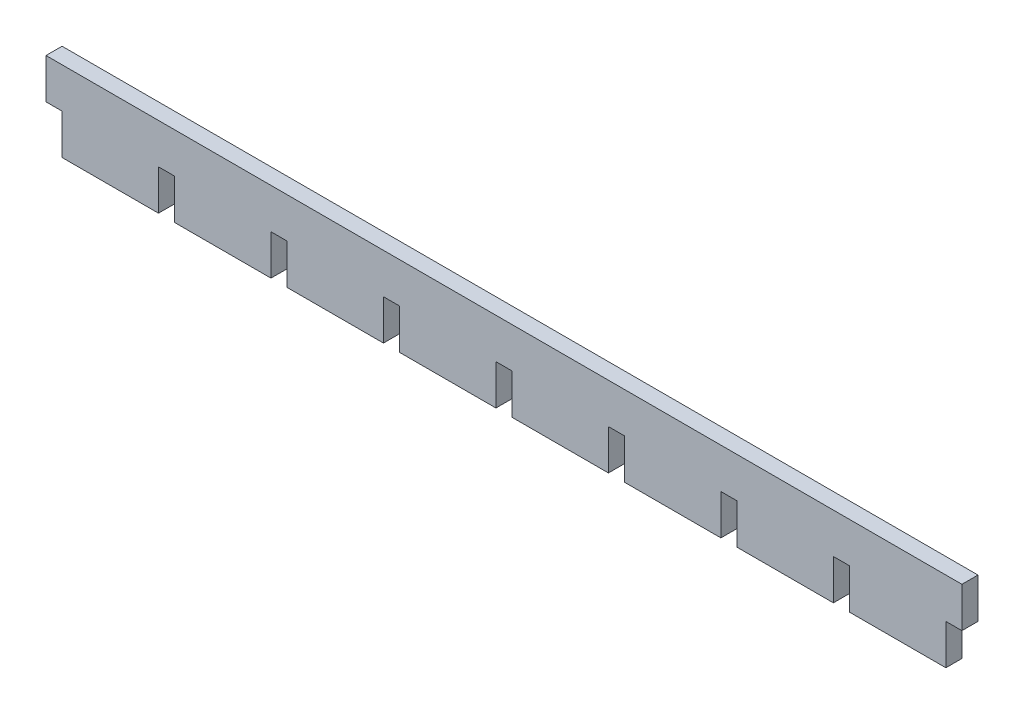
ISO-10303-21;
HEADER;
FILE_DESCRIPTION(('STEP AP214'),'2;1');
FILE_NAME('part.step','',(''),(''),'','','');
FILE_SCHEMA(('AUTOMOTIVE_DESIGN { 1 0 10303 214 1 1 1 1 }'));
ENDSEC;
DATA;
#1=APPLICATION_CONTEXT('core data for automotive mechanical design processes');
#2=APPLICATION_PROTOCOL_DEFINITION('international standard','automotive_design',2000,#1);
#3=PRODUCT_CONTEXT('',#1,'mechanical');
#4=PRODUCT('Part','Part','',(#3));
#5=PRODUCT_RELATED_PRODUCT_CATEGORY('part','',(#4));
#6=PRODUCT_DEFINITION_FORMATION('','',#4);
#7=PRODUCT_DEFINITION_CONTEXT('part definition',#1,'design');
#8=PRODUCT_DEFINITION('design','',#6,#7);
#9=PRODUCT_DEFINITION_SHAPE('','',#8);
#10=(LENGTH_UNIT() NAMED_UNIT(*) SI_UNIT(.MILLI.,.METRE.));
#11=(NAMED_UNIT(*) PLANE_ANGLE_UNIT() SI_UNIT($,.RADIAN.));
#12=(NAMED_UNIT(*) SI_UNIT($,.STERADIAN.) SOLID_ANGLE_UNIT());
#13=UNCERTAINTY_MEASURE_WITH_UNIT(LENGTH_MEASURE(1.E-05),#10,'distance_accuracy_value','');
#14=(GEOMETRIC_REPRESENTATION_CONTEXT(3) GLOBAL_UNCERTAINTY_ASSIGNED_CONTEXT((#13)) GLOBAL_UNIT_ASSIGNED_CONTEXT((#10,
#11,#12)) REPRESENTATION_CONTEXT('',''));
#15=CARTESIAN_POINT('',(0.,0.,0.));
#16=DIRECTION('',(0.,0.,1.));
#17=DIRECTION('',(1.,0.,0.));
#18=AXIS2_PLACEMENT_3D('',#15,#16,#17);
#19=CARTESIAN_POINT('',(336.,0.,6.));
#20=DIRECTION('',(1.,0.,0.));
#21=DIRECTION('',(0.,0.,-1.));
#22=AXIS2_PLACEMENT_3D('',#19,#20,#21);
#23=PLANE('',#22);
#24=DIRECTION('',(0.,-1.,0.));
#25=VECTOR('',#24,1.);
#26=CARTESIAN_POINT('',(336.,0.,0.));
#27=LINE('',#26,#25);
#28=CARTESIAN_POINT('',(336.,15.,0.));
#29=VERTEX_POINT('',#28);
#30=CARTESIAN_POINT('',(336.,0.,0.));
#31=VERTEX_POINT('',#30);
#32=EDGE_CURVE('E296',#29,#31,#27,.T.);
#33=ORIENTED_EDGE('',*,*,#32,.F.);
#34=DIRECTION('',(0.,0.,-1.));
#35=VECTOR('',#34,1.);
#36=CARTESIAN_POINT('',(336.,15.,6.));
#37=LINE('',#36,#35);
#38=CARTESIAN_POINT('',(336.,15.,6.));
#39=VERTEX_POINT('',#38);
#40=EDGE_CURVE('E11',#39,#29,#37,.T.);
#41=ORIENTED_EDGE('',*,*,#40,.F.);
#42=DIRECTION('',(0.,-1.,0.));
#43=VECTOR('',#42,1.);
#44=CARTESIAN_POINT('',(336.,0.,6.));
#45=LINE('',#44,#43);
#46=CARTESIAN_POINT('',(336.,0.,6.));
#47=VERTEX_POINT('',#46);
#48=EDGE_CURVE('E465',#39,#47,#45,.T.);
#49=ORIENTED_EDGE('',*,*,#48,.T.);
#50=DIRECTION('',(0.,0.,-1.));
#51=VECTOR('',#50,1.);
#52=CARTESIAN_POINT('',(336.,0.,6.));
#53=LINE('',#52,#51);
#54=EDGE_CURVE('E170',#47,#31,#53,.T.);
#55=ORIENTED_EDGE('',*,*,#54,.T.);
#56=EDGE_LOOP('',(#33,#41,#49,#55));
#57=FACE_BOUND('',#56,.T.);
#58=ADVANCED_FACE('F36',(#57),#23,.T.);
#59=CARTESIAN_POINT('',(0.,15.,6.));
#60=DIRECTION('',(0.,-1.,0.));
#61=DIRECTION('',(0.,0.,-1.));
#62=AXIS2_PLACEMENT_3D('',#59,#60,#61);
#63=PLANE('',#62);
#64=DIRECTION('',(-1.,0.,0.));
#65=VECTOR('',#64,1.);
#66=CARTESIAN_POINT('',(0.,15.,0.));
#67=LINE('',#66,#65);
#68=CARTESIAN_POINT('',(342.,15.,0.));
#69=VERTEX_POINT('',#68);
#70=EDGE_CURVE('E299',#69,#29,#67,.T.);
#71=ORIENTED_EDGE('',*,*,#70,.F.);
#72=DIRECTION('',(0.,0.,-1.));
#73=VECTOR('',#72,1.);
#74=CARTESIAN_POINT('',(342.,15.,6.));
#75=LINE('',#74,#73);
#76=CARTESIAN_POINT('',(342.,15.,6.));
#77=VERTEX_POINT('',#76);
#78=EDGE_CURVE('E44',#77,#69,#75,.T.);
#79=ORIENTED_EDGE('',*,*,#78,.F.);
#80=DIRECTION('',(-1.,0.,0.));
#81=VECTOR('',#80,1.);
#82=CARTESIAN_POINT('',(0.,15.,6.));
#83=LINE('',#82,#81);
#84=EDGE_CURVE('E462',#77,#39,#83,.T.);
#85=ORIENTED_EDGE('',*,*,#84,.T.);
#86=ORIENTED_EDGE('',*,*,#40,.T.);
#87=EDGE_LOOP('',(#71,#79,#85,#86));
#88=FACE_BOUND('',#87,.T.);
#89=ADVANCED_FACE('F461',(#88),#63,.T.);
#90=CARTESIAN_POINT('',(342.,0.,6.));
#91=DIRECTION('',(-1.,0.,0.));
#92=DIRECTION('',(0.,0.,1.));
#93=AXIS2_PLACEMENT_3D('',#90,#91,#92);
#94=PLANE('',#93);
#95=DIRECTION('',(0.,1.,0.));
#96=VECTOR('',#95,1.);
#97=CARTESIAN_POINT('',(342.,0.,0.));
#98=LINE('',#97,#96);
#99=CARTESIAN_POINT('',(342.,30.,0.));
#100=VERTEX_POINT('',#99);
#101=EDGE_CURVE('E302',#69,#100,#98,.T.);
#102=ORIENTED_EDGE('',*,*,#101,.T.);
#103=DIRECTION('',(0.,0.,-1.));
#104=VECTOR('',#103,1.);
#105=CARTESIAN_POINT('',(342.,30.,6.));
#106=LINE('',#105,#104);
#107=CARTESIAN_POINT('',(342.,30.,6.));
#108=VERTEX_POINT('',#107);
#109=EDGE_CURVE('E447',#108,#100,#106,.T.);
#110=ORIENTED_EDGE('',*,*,#109,.F.);
#111=DIRECTION('',(0.,1.,0.));
#112=VECTOR('',#111,1.);
#113=CARTESIAN_POINT('',(342.,0.,6.));
#114=LINE('',#113,#112);
#115=EDGE_CURVE('E453',#77,#108,#114,.T.);
#116=ORIENTED_EDGE('',*,*,#115,.F.);
#117=ORIENTED_EDGE('',*,*,#78,.T.);
#118=EDGE_LOOP('',(#102,#110,#116,#117));
#119=FACE_BOUND('',#118,.T.);
#120=ADVANCED_FACE('F451',(#119),#94,.F.);
#121=CARTESIAN_POINT('',(0.,30.,6.));
#122=DIRECTION('',(0.,1.,0.));
#123=DIRECTION('',(0.,0.,1.));
#124=AXIS2_PLACEMENT_3D('',#121,#122,#123);
#125=PLANE('',#124);
#126=DIRECTION('',(1.,0.,0.));
#127=VECTOR('',#126,1.);
#128=CARTESIAN_POINT('',(0.,30.,0.));
#129=LINE('',#128,#127);
#130=CARTESIAN_POINT('',(0.,30.,0.));
#131=VERTEX_POINT('',#130);
#132=EDGE_CURVE('E305',#131,#100,#129,.T.);
#133=ORIENTED_EDGE('',*,*,#132,.F.);
#134=DIRECTION('',(0.,0.,-1.));
#135=VECTOR('',#134,1.);
#136=CARTESIAN_POINT('',(0.,30.,6.));
#137=LINE('',#136,#135);
#138=CARTESIAN_POINT('',(0.,30.,6.));
#139=VERTEX_POINT('',#138);
#140=EDGE_CURVE('E445',#139,#131,#137,.T.);
#141=ORIENTED_EDGE('',*,*,#140,.F.);
#142=DIRECTION('',(1.,0.,0.));
#143=VECTOR('',#142,1.);
#144=CARTESIAN_POINT('',(0.,30.,6.));
#145=LINE('',#144,#143);
#146=EDGE_CURVE('E572',#139,#108,#145,.T.);
#147=ORIENTED_EDGE('',*,*,#146,.T.);
#148=ORIENTED_EDGE('',*,*,#109,.T.);
#149=EDGE_LOOP('',(#133,#141,#147,#148));
#150=FACE_BOUND('',#149,.T.);
#151=ADVANCED_FACE('F579',(#150),#125,.T.);
#152=CARTESIAN_POINT('',(0.,0.,6.));
#153=DIRECTION('',(-1.,0.,0.));
#154=DIRECTION('',(0.,0.,1.));
#155=AXIS2_PLACEMENT_3D('',#152,#153,#154);
#156=PLANE('',#155);
#157=DIRECTION('',(0.,1.,0.));
#158=VECTOR('',#157,1.);
#159=CARTESIAN_POINT('',(0.,0.,0.));
#160=LINE('',#159,#158);
#161=CARTESIAN_POINT('',(0.,15.,0.));
#162=VERTEX_POINT('',#161);
#163=EDGE_CURVE('E308',#162,#131,#160,.T.);
#164=ORIENTED_EDGE('',*,*,#163,.F.);
#165=DIRECTION('',(0.,0.,-1.));
#166=VECTOR('',#165,1.);
#167=CARTESIAN_POINT('',(0.,15.,6.));
#168=LINE('',#167,#166);
#169=CARTESIAN_POINT('',(0.,15.,6.));
#170=VERTEX_POINT('',#169);
#171=EDGE_CURVE('E443',#170,#162,#168,.T.);
#172=ORIENTED_EDGE('',*,*,#171,.F.);
#173=DIRECTION('',(0.,1.,0.));
#174=VECTOR('',#173,1.);
#175=CARTESIAN_POINT('',(0.,0.,6.));
#176=LINE('',#175,#174);
#177=EDGE_CURVE('E567',#170,#139,#176,.T.);
#178=ORIENTED_EDGE('',*,*,#177,.T.);
#179=ORIENTED_EDGE('',*,*,#140,.T.);
#180=EDGE_LOOP('',(#164,#172,#178,#179));
#181=FACE_BOUND('',#180,.T.);
#182=ADVANCED_FACE('F582',(#181),#156,.T.);
#183=CARTESIAN_POINT('',(0.,15.,6.));
#184=DIRECTION('',(0.,1.,0.));
#185=DIRECTION('',(0.,0.,1.));
#186=AXIS2_PLACEMENT_3D('',#183,#184,#185);
#187=PLANE('',#186);
#188=DIRECTION('',(1.,0.,0.));
#189=VECTOR('',#188,1.);
#190=CARTESIAN_POINT('',(0.,15.,0.));
#191=LINE('',#190,#189);
#192=CARTESIAN_POINT('',(6.,15.,0.));
#193=VERTEX_POINT('',#192);
#194=EDGE_CURVE('E311',#162,#193,#191,.T.);
#195=ORIENTED_EDGE('',*,*,#194,.T.);
#196=DIRECTION('',(0.,0.,-1.));
#197=VECTOR('',#196,1.);
#198=CARTESIAN_POINT('',(6.,15.,6.));
#199=LINE('',#198,#197);
#200=CARTESIAN_POINT('',(6.,15.,6.));
#201=VERTEX_POINT('',#200);
#202=EDGE_CURVE('E440',#201,#193,#199,.T.);
#203=ORIENTED_EDGE('',*,*,#202,.F.);
#204=DIRECTION('',(1.,0.,0.));
#205=VECTOR('',#204,1.);
#206=CARTESIAN_POINT('',(0.,15.,6.));
#207=LINE('',#206,#205);
#208=EDGE_CURVE('E564',#170,#201,#207,.T.);
#209=ORIENTED_EDGE('',*,*,#208,.F.);
#210=ORIENTED_EDGE('',*,*,#171,.T.);
#211=EDGE_LOOP('',(#195,#203,#209,#210));
#212=FACE_BOUND('',#211,.T.);
#213=ADVANCED_FACE('F586',(#212),#187,.F.);
#214=CARTESIAN_POINT('',(6.,0.,6.));
#215=DIRECTION('',(1.,0.,0.));
#216=DIRECTION('',(0.,0.,-1.));
#217=AXIS2_PLACEMENT_3D('',#214,#215,#216);
#218=PLANE('',#217);
#219=DIRECTION('',(0.,-1.,0.));
#220=VECTOR('',#219,1.);
#221=CARTESIAN_POINT('',(6.,0.,0.));
#222=LINE('',#221,#220);
#223=CARTESIAN_POINT('',(6.,0.,0.));
#224=VERTEX_POINT('',#223);
#225=EDGE_CURVE('E313',#193,#224,#222,.T.);
#226=ORIENTED_EDGE('',*,*,#225,.T.);
#227=DIRECTION('',(0.,0.,-1.));
#228=VECTOR('',#227,1.);
#229=CARTESIAN_POINT('',(6.,0.,6.));
#230=LINE('',#229,#228);
#231=CARTESIAN_POINT('',(6.,0.,6.));
#232=VERTEX_POINT('',#231);
#233=EDGE_CURVE('E437',#232,#224,#230,.T.);
#234=ORIENTED_EDGE('',*,*,#233,.F.);
#235=DIRECTION('',(0.,-1.,0.));
#236=VECTOR('',#235,1.);
#237=CARTESIAN_POINT('',(6.,0.,6.));
#238=LINE('',#237,#236);
#239=EDGE_CURVE('E558',#201,#232,#238,.T.);
#240=ORIENTED_EDGE('',*,*,#239,.F.);
#241=ORIENTED_EDGE('',*,*,#202,.T.);
#242=EDGE_LOOP('',(#226,#234,#240,#241));
#243=FACE_BOUND('',#242,.T.);
#244=ADVANCED_FACE('F590',(#243),#218,.F.);
#245=CARTESIAN_POINT('',(0.,0.,6.));
#246=DIRECTION('',(0.,1.,0.));
#247=DIRECTION('',(0.,0.,1.));
#248=AXIS2_PLACEMENT_3D('',#245,#246,#247);
#249=PLANE('',#248);
#250=DIRECTION('',(1.,0.,0.));
#251=VECTOR('',#250,1.);
#252=CARTESIAN_POINT('',(0.,0.,0.));
#253=LINE('',#252,#251);
#254=CARTESIAN_POINT('',(42.,0.,0.));
#255=VERTEX_POINT('',#254);
#256=EDGE_CURVE('E315',#224,#255,#253,.T.);
#257=ORIENTED_EDGE('',*,*,#256,.T.);
#258=DIRECTION('',(0.,0.,-1.));
#259=VECTOR('',#258,1.);
#260=CARTESIAN_POINT('',(42.,0.,6.));
#261=LINE('',#260,#259);
#262=CARTESIAN_POINT('',(42.,0.,6.));
#263=VERTEX_POINT('',#262);
#264=EDGE_CURVE('E435',#263,#255,#261,.T.);
#265=ORIENTED_EDGE('',*,*,#264,.F.);
#266=DIRECTION('',(1.,0.,0.));
#267=VECTOR('',#266,1.);
#268=CARTESIAN_POINT('',(0.,0.,6.));
#269=LINE('',#268,#267);
#270=EDGE_CURVE('E512',#232,#263,#269,.T.);
#271=ORIENTED_EDGE('',*,*,#270,.F.);
#272=ORIENTED_EDGE('',*,*,#233,.T.);
#273=EDGE_LOOP('',(#257,#265,#271,#272));
#274=FACE_BOUND('',#273,.T.);
#275=ADVANCED_FACE('F593',(#274),#249,.F.);
#276=CARTESIAN_POINT('',(42.,0.,6.));
#277=DIRECTION('',(1.,0.,0.));
#278=DIRECTION('',(0.,0.,-1.));
#279=AXIS2_PLACEMENT_3D('',#276,#277,#278);
#280=PLANE('',#279);
#281=DIRECTION('',(0.,-1.,0.));
#282=VECTOR('',#281,1.);
#283=CARTESIAN_POINT('',(42.,0.,0.));
#284=LINE('',#283,#282);
#285=CARTESIAN_POINT('',(42.,15.,0.));
#286=VERTEX_POINT('',#285);
#287=EDGE_CURVE('E318',#286,#255,#284,.T.);
#288=ORIENTED_EDGE('',*,*,#287,.F.);
#289=DIRECTION('',(0.,0.,-1.));
#290=VECTOR('',#289,1.);
#291=CARTESIAN_POINT('',(42.,15.,6.));
#292=LINE('',#291,#290);
#293=CARTESIAN_POINT('',(42.,15.,6.));
#294=VERTEX_POINT('',#293);
#295=EDGE_CURVE('E433',#294,#286,#292,.T.);
#296=ORIENTED_EDGE('',*,*,#295,.F.);
#297=DIRECTION('',(0.,-1.,0.));
#298=VECTOR('',#297,1.);
#299=CARTESIAN_POINT('',(42.,0.,6.));
#300=LINE('',#299,#298);
#301=EDGE_CURVE('E557',#294,#263,#300,.T.);
#302=ORIENTED_EDGE('',*,*,#301,.T.);
#303=ORIENTED_EDGE('',*,*,#264,.T.);
#304=EDGE_LOOP('',(#288,#296,#302,#303));
#305=FACE_BOUND('',#304,.T.);
#306=ADVANCED_FACE('F596',(#305),#280,.T.);
#307=CARTESIAN_POINT('',(0.,15.,6.));
#308=DIRECTION('',(0.,-1.,0.));
#309=DIRECTION('',(0.,0.,-1.));
#310=AXIS2_PLACEMENT_3D('',#307,#308,#309);
#311=PLANE('',#310);
#312=DIRECTION('',(-1.,0.,0.));
#313=VECTOR('',#312,1.);
#314=CARTESIAN_POINT('',(0.,15.,0.));
#315=LINE('',#314,#313);
#316=CARTESIAN_POINT('',(48.,15.,0.));
#317=VERTEX_POINT('',#316);
#318=EDGE_CURVE('E323',#317,#286,#315,.T.);
#319=ORIENTED_EDGE('',*,*,#318,.F.);
#320=DIRECTION('',(0.,0.,-1.));
#321=VECTOR('',#320,1.);
#322=CARTESIAN_POINT('',(48.,15.,6.));
#323=LINE('',#322,#321);
#324=CARTESIAN_POINT('',(48.,15.,6.));
#325=VERTEX_POINT('',#324);
#326=EDGE_CURVE('E431',#325,#317,#323,.T.);
#327=ORIENTED_EDGE('',*,*,#326,.F.);
#328=DIRECTION('',(-1.,0.,0.));
#329=VECTOR('',#328,1.);
#330=CARTESIAN_POINT('',(0.,15.,6.));
#331=LINE('',#330,#329);
#332=EDGE_CURVE('E563',#325,#294,#331,.T.);
#333=ORIENTED_EDGE('',*,*,#332,.T.);
#334=ORIENTED_EDGE('',*,*,#295,.T.);
#335=EDGE_LOOP('',(#319,#327,#333,#334));
#336=FACE_BOUND('',#335,.T.);
#337=ADVANCED_FACE('F601',(#336),#311,.T.);
#338=CARTESIAN_POINT('',(48.,0.,6.));
#339=DIRECTION('',(1.,0.,0.));
#340=DIRECTION('',(0.,0.,-1.));
#341=AXIS2_PLACEMENT_3D('',#338,#339,#340);
#342=PLANE('',#341);
#343=DIRECTION('',(0.,-1.,0.));
#344=VECTOR('',#343,1.);
#345=CARTESIAN_POINT('',(48.,0.,0.));
#346=LINE('',#345,#344);
#347=CARTESIAN_POINT('',(48.,0.,0.));
#348=VERTEX_POINT('',#347);
#349=EDGE_CURVE('E326',#317,#348,#346,.T.);
#350=ORIENTED_EDGE('',*,*,#349,.T.);
#351=DIRECTION('',(0.,0.,-1.));
#352=VECTOR('',#351,1.);
#353=CARTESIAN_POINT('',(48.,0.,6.));
#354=LINE('',#353,#352);
#355=CARTESIAN_POINT('',(48.,0.,6.));
#356=VERTEX_POINT('',#355);
#357=EDGE_CURVE('E428',#356,#348,#354,.T.);
#358=ORIENTED_EDGE('',*,*,#357,.F.);
#359=DIRECTION('',(0.,-1.,0.));
#360=VECTOR('',#359,1.);
#361=CARTESIAN_POINT('',(48.,0.,6.));
#362=LINE('',#361,#360);
#363=EDGE_CURVE('E510',#325,#356,#362,.T.);
#364=ORIENTED_EDGE('',*,*,#363,.F.);
#365=ORIENTED_EDGE('',*,*,#326,.T.);
#366=EDGE_LOOP('',(#350,#358,#364,#365));
#367=FACE_BOUND('',#366,.T.);
#368=ADVANCED_FACE('F604',(#367),#342,.F.);
#369=CARTESIAN_POINT('',(84.,0.,0.));
#370=VERTEX_POINT('',#369);
#371=EDGE_CURVE('E320',#348,#370,#253,.T.);
#372=ORIENTED_EDGE('',*,*,#371,.T.);
#373=DIRECTION('',(0.,0.,-1.));
#374=VECTOR('',#373,1.);
#375=CARTESIAN_POINT('',(84.,0.,6.));
#376=LINE('',#375,#374);
#377=CARTESIAN_POINT('',(84.,0.,6.));
#378=VERTEX_POINT('',#377);
#379=EDGE_CURVE('E426',#378,#370,#376,.T.);
#380=ORIENTED_EDGE('',*,*,#379,.F.);
#381=EDGE_CURVE('E506',#356,#378,#269,.T.);
#382=ORIENTED_EDGE('',*,*,#381,.F.);
#383=ORIENTED_EDGE('',*,*,#357,.T.);
#384=EDGE_LOOP('',(#372,#380,#382,#383));
#385=FACE_BOUND('',#384,.T.);
#386=ADVANCED_FACE('F491',(#385),#249,.F.);
#387=CARTESIAN_POINT('',(84.,0.,6.));
#388=DIRECTION('',(1.,0.,0.));
#389=DIRECTION('',(0.,0.,-1.));
#390=AXIS2_PLACEMENT_3D('',#387,#388,#389);
#391=PLANE('',#390);
#392=DIRECTION('',(0.,-1.,0.));
#393=VECTOR('',#392,1.);
#394=CARTESIAN_POINT('',(84.,0.,0.));
#395=LINE('',#394,#393);
#396=CARTESIAN_POINT('',(84.,15.,0.));
#397=VERTEX_POINT('',#396);
#398=EDGE_CURVE('E328',#397,#370,#395,.T.);
#399=ORIENTED_EDGE('',*,*,#398,.F.);
#400=DIRECTION('',(0.,0.,-1.));
#401=VECTOR('',#400,1.);
#402=CARTESIAN_POINT('',(84.,15.,6.));
#403=LINE('',#402,#401);
#404=CARTESIAN_POINT('',(84.,15.,6.));
#405=VERTEX_POINT('',#404);
#406=EDGE_CURVE('E424',#405,#397,#403,.T.);
#407=ORIENTED_EDGE('',*,*,#406,.F.);
#408=DIRECTION('',(0.,-1.,0.));
#409=VECTOR('',#408,1.);
#410=CARTESIAN_POINT('',(84.,0.,6.));
#411=LINE('',#410,#409);
#412=EDGE_CURVE('E502',#405,#378,#411,.T.);
#413=ORIENTED_EDGE('',*,*,#412,.T.);
#414=ORIENTED_EDGE('',*,*,#379,.T.);
#415=EDGE_LOOP('',(#399,#407,#413,#414));
#416=FACE_BOUND('',#415,.T.);
#417=ADVANCED_FACE('F500',(#416),#391,.T.);
#418=CARTESIAN_POINT('',(0.,15.,6.));
#419=DIRECTION('',(0.,-1.,0.));
#420=DIRECTION('',(0.,0.,-1.));
#421=AXIS2_PLACEMENT_3D('',#418,#419,#420);
#422=PLANE('',#421);
#423=DIRECTION('',(-1.,0.,0.));
#424=VECTOR('',#423,1.);
#425=CARTESIAN_POINT('',(0.,15.,0.));
#426=LINE('',#425,#424);
#427=CARTESIAN_POINT('',(90.,15.,0.));
#428=VERTEX_POINT('',#427);
#429=EDGE_CURVE('E331',#428,#397,#426,.T.);
#430=ORIENTED_EDGE('',*,*,#429,.F.);
#431=DIRECTION('',(0.,0.,-1.));
#432=VECTOR('',#431,1.);
#433=CARTESIAN_POINT('',(90.,15.,6.));
#434=LINE('',#433,#432);
#435=CARTESIAN_POINT('',(90.,15.,6.));
#436=VERTEX_POINT('',#435);
#437=EDGE_CURVE('E422',#436,#428,#434,.T.);
#438=ORIENTED_EDGE('',*,*,#437,.F.);
#439=DIRECTION('',(-1.,0.,0.));
#440=VECTOR('',#439,1.);
#441=CARTESIAN_POINT('',(0.,15.,6.));
#442=LINE('',#441,#440);
#443=EDGE_CURVE('E505',#436,#405,#442,.T.);
#444=ORIENTED_EDGE('',*,*,#443,.T.);
#445=ORIENTED_EDGE('',*,*,#406,.T.);
#446=EDGE_LOOP('',(#430,#438,#444,#445));
#447=FACE_BOUND('',#446,.T.);
#448=ADVANCED_FACE('F708',(#447),#422,.T.);
#449=CARTESIAN_POINT('',(90.,0.,6.));
#450=DIRECTION('',(1.,0.,0.));
#451=DIRECTION('',(0.,0.,-1.));
#452=AXIS2_PLACEMENT_3D('',#449,#450,#451);
#453=PLANE('',#452);
#454=DIRECTION('',(0.,-1.,0.));
#455=VECTOR('',#454,1.);
#456=CARTESIAN_POINT('',(90.,0.,0.));
#457=LINE('',#456,#455);
#458=CARTESIAN_POINT('',(90.,0.,0.));
#459=VERTEX_POINT('',#458);
#460=EDGE_CURVE('E334',#428,#459,#457,.T.);
#461=ORIENTED_EDGE('',*,*,#460,.T.);
#462=DIRECTION('',(0.,0.,-1.));
#463=VECTOR('',#462,1.);
#464=CARTESIAN_POINT('',(90.,0.,6.));
#465=LINE('',#464,#463);
#466=CARTESIAN_POINT('',(90.,0.,6.));
#467=VERTEX_POINT('',#466);
#468=EDGE_CURVE('E419',#467,#459,#465,.T.);
#469=ORIENTED_EDGE('',*,*,#468,.F.);
#470=DIRECTION('',(0.,-1.,0.));
#471=VECTOR('',#470,1.);
#472=CARTESIAN_POINT('',(90.,0.,6.));
#473=LINE('',#472,#471);
#474=EDGE_CURVE('E508',#436,#467,#473,.T.);
#475=ORIENTED_EDGE('',*,*,#474,.F.);
#476=ORIENTED_EDGE('',*,*,#437,.T.);
#477=EDGE_LOOP('',(#461,#469,#475,#476));
#478=FACE_BOUND('',#477,.T.);
#479=ADVANCED_FACE('F701',(#478),#453,.F.);
#480=CARTESIAN_POINT('',(126.,0.,0.));
#481=VERTEX_POINT('',#480);
#482=EDGE_CURVE('E336',#459,#481,#253,.T.);
#483=ORIENTED_EDGE('',*,*,#482,.T.);
#484=DIRECTION('',(0.,0.,-1.));
#485=VECTOR('',#484,1.);
#486=CARTESIAN_POINT('',(126.,0.,6.));
#487=LINE('',#486,#485);
#488=CARTESIAN_POINT('',(126.,0.,6.));
#489=VERTEX_POINT('',#488);
#490=EDGE_CURVE('E417',#489,#481,#487,.T.);
#491=ORIENTED_EDGE('',*,*,#490,.F.);
#492=EDGE_CURVE('E513',#467,#489,#269,.T.);
#493=ORIENTED_EDGE('',*,*,#492,.F.);
#494=ORIENTED_EDGE('',*,*,#468,.T.);
#495=EDGE_LOOP('',(#483,#491,#493,#494));
#496=FACE_BOUND('',#495,.T.);
#497=ADVANCED_FACE('F612',(#496),#249,.F.);
#498=CARTESIAN_POINT('',(126.,0.,6.));
#499=DIRECTION('',(1.,0.,0.));
#500=DIRECTION('',(0.,0.,-1.));
#501=AXIS2_PLACEMENT_3D('',#498,#499,#500);
#502=PLANE('',#501);
#503=DIRECTION('',(0.,-1.,0.));
#504=VECTOR('',#503,1.);
#505=CARTESIAN_POINT('',(126.,0.,0.));
#506=LINE('',#505,#504);
#507=CARTESIAN_POINT('',(126.,15.,0.));
#508=VERTEX_POINT('',#507);
#509=EDGE_CURVE('E337',#508,#481,#506,.T.);
#510=ORIENTED_EDGE('',*,*,#509,.F.);
#511=DIRECTION('',(0.,0.,-1.));
#512=VECTOR('',#511,1.);
#513=CARTESIAN_POINT('',(126.,15.,6.));
#514=LINE('',#513,#512);
#515=CARTESIAN_POINT('',(126.,15.,6.));
#516=VERTEX_POINT('',#515);
#517=EDGE_CURVE('E415',#516,#508,#514,.T.);
#518=ORIENTED_EDGE('',*,*,#517,.F.);
#519=DIRECTION('',(0.,-1.,0.));
#520=VECTOR('',#519,1.);
#521=CARTESIAN_POINT('',(126.,0.,6.));
#522=LINE('',#521,#520);
#523=EDGE_CURVE('E518',#516,#489,#522,.T.);
#524=ORIENTED_EDGE('',*,*,#523,.T.);
#525=ORIENTED_EDGE('',*,*,#490,.T.);
#526=EDGE_LOOP('',(#510,#518,#524,#525));
#527=FACE_BOUND('',#526,.T.);
#528=ADVANCED_FACE('F700',(#527),#502,.T.);
#529=CARTESIAN_POINT('',(0.,15.,6.));
#530=DIRECTION('',(0.,-1.,0.));
#531=DIRECTION('',(0.,0.,-1.));
#532=AXIS2_PLACEMENT_3D('',#529,#530,#531);
#533=PLANE('',#532);
#534=DIRECTION('',(-1.,0.,0.));
#535=VECTOR('',#534,1.);
#536=CARTESIAN_POINT('',(0.,15.,0.));
#537=LINE('',#536,#535);
#538=CARTESIAN_POINT('',(132.,15.,0.));
#539=VERTEX_POINT('',#538);
#540=EDGE_CURVE('E340',#539,#508,#537,.T.);
#541=ORIENTED_EDGE('',*,*,#540,.F.);
#542=DIRECTION('',(0.,0.,-1.));
#543=VECTOR('',#542,1.);
#544=CARTESIAN_POINT('',(132.,15.,6.));
#545=LINE('',#544,#543);
#546=CARTESIAN_POINT('',(132.,15.,6.));
#547=VERTEX_POINT('',#546);
#548=EDGE_CURVE('E413',#547,#539,#545,.T.);
#549=ORIENTED_EDGE('',*,*,#548,.F.);
#550=DIRECTION('',(-1.,0.,0.));
#551=VECTOR('',#550,1.);
#552=CARTESIAN_POINT('',(0.,15.,6.));
#553=LINE('',#552,#551);
#554=EDGE_CURVE('E521',#547,#516,#553,.T.);
#555=ORIENTED_EDGE('',*,*,#554,.T.);
#556=ORIENTED_EDGE('',*,*,#517,.T.);
#557=EDGE_LOOP('',(#541,#549,#555,#556));
#558=FACE_BOUND('',#557,.T.);
#559=ADVANCED_FACE('F696',(#558),#533,.T.);
#560=CARTESIAN_POINT('',(132.,0.,6.));
#561=DIRECTION('',(1.,0.,0.));
#562=DIRECTION('',(0.,0.,-1.));
#563=AXIS2_PLACEMENT_3D('',#560,#561,#562);
#564=PLANE('',#563);
#565=DIRECTION('',(0.,-1.,0.));
#566=VECTOR('',#565,1.);
#567=CARTESIAN_POINT('',(132.,0.,0.));
#568=LINE('',#567,#566);
#569=CARTESIAN_POINT('',(132.,0.,0.));
#570=VERTEX_POINT('',#569);
#571=EDGE_CURVE('E343',#539,#570,#568,.T.);
#572=ORIENTED_EDGE('',*,*,#571,.T.);
#573=DIRECTION('',(0.,0.,-1.));
#574=VECTOR('',#573,1.);
#575=CARTESIAN_POINT('',(132.,0.,6.));
#576=LINE('',#575,#574);
#577=CARTESIAN_POINT('',(132.,0.,6.));
#578=VERTEX_POINT('',#577);
#579=EDGE_CURVE('E410',#578,#570,#576,.T.);
#580=ORIENTED_EDGE('',*,*,#579,.F.);
#581=DIRECTION('',(0.,-1.,0.));
#582=VECTOR('',#581,1.);
#583=CARTESIAN_POINT('',(132.,0.,6.));
#584=LINE('',#583,#582);
#585=EDGE_CURVE('E524',#547,#578,#584,.T.);
#586=ORIENTED_EDGE('',*,*,#585,.F.);
#587=ORIENTED_EDGE('',*,*,#548,.T.);
#588=EDGE_LOOP('',(#572,#580,#586,#587));
#589=FACE_BOUND('',#588,.T.);
#590=ADVANCED_FACE('F689',(#589),#564,.F.);
#591=CARTESIAN_POINT('',(168.,0.,0.));
#592=VERTEX_POINT('',#591);
#593=EDGE_CURVE('E345',#570,#592,#253,.T.);
#594=ORIENTED_EDGE('',*,*,#593,.T.);
#595=DIRECTION('',(0.,0.,-1.));
#596=VECTOR('',#595,1.);
#597=CARTESIAN_POINT('',(168.,0.,6.));
#598=LINE('',#597,#596);
#599=CARTESIAN_POINT('',(168.,0.,6.));
#600=VERTEX_POINT('',#599);
#601=EDGE_CURVE('E408',#600,#592,#598,.T.);
#602=ORIENTED_EDGE('',*,*,#601,.F.);
#603=EDGE_CURVE('E526',#578,#600,#269,.T.);
#604=ORIENTED_EDGE('',*,*,#603,.F.);
#605=ORIENTED_EDGE('',*,*,#579,.T.);
#606=EDGE_LOOP('',(#594,#602,#604,#605));
#607=FACE_BOUND('',#606,.T.);
#608=ADVANCED_FACE('F677',(#607),#249,.F.);
#609=CARTESIAN_POINT('',(168.,0.,6.));
#610=DIRECTION('',(1.,0.,0.));
#611=DIRECTION('',(0.,0.,-1.));
#612=AXIS2_PLACEMENT_3D('',#609,#610,#611);
#613=PLANE('',#612);
#614=DIRECTION('',(0.,-1.,0.));
#615=VECTOR('',#614,1.);
#616=CARTESIAN_POINT('',(168.,0.,0.));
#617=LINE('',#616,#615);
#618=CARTESIAN_POINT('',(168.,15.,0.));
#619=VERTEX_POINT('',#618);
#620=EDGE_CURVE('E346',#619,#592,#617,.T.);
#621=ORIENTED_EDGE('',*,*,#620,.F.);
#622=DIRECTION('',(0.,0.,-1.));
#623=VECTOR('',#622,1.);
#624=CARTESIAN_POINT('',(168.,15.,6.));
#625=LINE('',#624,#623);
#626=CARTESIAN_POINT('',(168.,15.,6.));
#627=VERTEX_POINT('',#626);
#628=EDGE_CURVE('E406',#627,#619,#625,.T.);
#629=ORIENTED_EDGE('',*,*,#628,.F.);
#630=DIRECTION('',(0.,-1.,0.));
#631=VECTOR('',#630,1.);
#632=CARTESIAN_POINT('',(168.,0.,6.));
#633=LINE('',#632,#631);
#634=EDGE_CURVE('E527',#627,#600,#633,.T.);
#635=ORIENTED_EDGE('',*,*,#634,.T.);
#636=ORIENTED_EDGE('',*,*,#601,.T.);
#637=EDGE_LOOP('',(#621,#629,#635,#636));
#638=FACE_BOUND('',#637,.T.);
#639=ADVANCED_FACE('F688',(#638),#613,.T.);
#640=CARTESIAN_POINT('',(0.,15.,6.));
#641=DIRECTION('',(0.,-1.,0.));
#642=DIRECTION('',(0.,0.,-1.));
#643=AXIS2_PLACEMENT_3D('',#640,#641,#642);
#644=PLANE('',#643);
#645=DIRECTION('',(-1.,0.,0.));
#646=VECTOR('',#645,1.);
#647=CARTESIAN_POINT('',(0.,15.,0.));
#648=LINE('',#647,#646);
#649=CARTESIAN_POINT('',(174.,15.,0.));
#650=VERTEX_POINT('',#649);
#651=EDGE_CURVE('E349',#650,#619,#648,.T.);
#652=ORIENTED_EDGE('',*,*,#651,.F.);
#653=DIRECTION('',(0.,0.,-1.));
#654=VECTOR('',#653,1.);
#655=CARTESIAN_POINT('',(174.,15.,6.));
#656=LINE('',#655,#654);
#657=CARTESIAN_POINT('',(174.,15.,6.));
#658=VERTEX_POINT('',#657);
#659=EDGE_CURVE('E404',#658,#650,#656,.T.);
#660=ORIENTED_EDGE('',*,*,#659,.F.);
#661=DIRECTION('',(-1.,0.,0.));
#662=VECTOR('',#661,1.);
#663=CARTESIAN_POINT('',(0.,15.,6.));
#664=LINE('',#663,#662);
#665=EDGE_CURVE('E530',#658,#627,#664,.T.);
#666=ORIENTED_EDGE('',*,*,#665,.T.);
#667=ORIENTED_EDGE('',*,*,#628,.T.);
#668=EDGE_LOOP('',(#652,#660,#666,#667));
#669=FACE_BOUND('',#668,.T.);
#670=ADVANCED_FACE('F684',(#669),#644,.T.);
#671=CARTESIAN_POINT('',(174.,0.,6.));
#672=DIRECTION('',(1.,0.,0.));
#673=DIRECTION('',(0.,0.,-1.));
#674=AXIS2_PLACEMENT_3D('',#671,#672,#673);
#675=PLANE('',#674);
#676=DIRECTION('',(0.,-1.,0.));
#677=VECTOR('',#676,1.);
#678=CARTESIAN_POINT('',(174.,0.,0.));
#679=LINE('',#678,#677);
#680=CARTESIAN_POINT('',(174.,0.,0.));
#681=VERTEX_POINT('',#680);
#682=EDGE_CURVE('E352',#650,#681,#679,.T.);
#683=ORIENTED_EDGE('',*,*,#682,.T.);
#684=DIRECTION('',(0.,0.,-1.));
#685=VECTOR('',#684,1.);
#686=CARTESIAN_POINT('',(174.,0.,6.));
#687=LINE('',#686,#685);
#688=CARTESIAN_POINT('',(174.,0.,6.));
#689=VERTEX_POINT('',#688);
#690=EDGE_CURVE('E401',#689,#681,#687,.T.);
#691=ORIENTED_EDGE('',*,*,#690,.F.);
#692=DIRECTION('',(0.,-1.,0.));
#693=VECTOR('',#692,1.);
#694=CARTESIAN_POINT('',(174.,0.,6.));
#695=LINE('',#694,#693);
#696=EDGE_CURVE('E533',#658,#689,#695,.T.);
#697=ORIENTED_EDGE('',*,*,#696,.F.);
#698=ORIENTED_EDGE('',*,*,#659,.T.);
#699=EDGE_LOOP('',(#683,#691,#697,#698));
#700=FACE_BOUND('',#699,.T.);
#701=ADVANCED_FACE('F676',(#700),#675,.F.);
#702=CARTESIAN_POINT('',(210.,0.,0.));
#703=VERTEX_POINT('',#702);
#704=EDGE_CURVE('E354',#681,#703,#253,.T.);
#705=ORIENTED_EDGE('',*,*,#704,.T.);
#706=DIRECTION('',(0.,0.,-1.));
#707=VECTOR('',#706,1.);
#708=CARTESIAN_POINT('',(210.,0.,6.));
#709=LINE('',#708,#707);
#710=CARTESIAN_POINT('',(210.,0.,6.));
#711=VERTEX_POINT('',#710);
#712=EDGE_CURVE('E399',#711,#703,#709,.T.);
#713=ORIENTED_EDGE('',*,*,#712,.F.);
#714=EDGE_CURVE('E535',#689,#711,#269,.T.);
#715=ORIENTED_EDGE('',*,*,#714,.F.);
#716=ORIENTED_EDGE('',*,*,#690,.T.);
#717=EDGE_LOOP('',(#705,#713,#715,#716));
#718=FACE_BOUND('',#717,.T.);
#719=ADVANCED_FACE('F664',(#718),#249,.F.);
#720=CARTESIAN_POINT('',(210.,0.,6.));
#721=DIRECTION('',(1.,0.,0.));
#722=DIRECTION('',(0.,0.,-1.));
#723=AXIS2_PLACEMENT_3D('',#720,#721,#722);
#724=PLANE('',#723);
#725=DIRECTION('',(0.,-1.,0.));
#726=VECTOR('',#725,1.);
#727=CARTESIAN_POINT('',(210.,0.,0.));
#728=LINE('',#727,#726);
#729=CARTESIAN_POINT('',(210.,15.,0.));
#730=VERTEX_POINT('',#729);
#731=EDGE_CURVE('E355',#730,#703,#728,.T.);
#732=ORIENTED_EDGE('',*,*,#731,.F.);
#733=DIRECTION('',(0.,0.,-1.));
#734=VECTOR('',#733,1.);
#735=CARTESIAN_POINT('',(210.,15.,6.));
#736=LINE('',#735,#734);
#737=CARTESIAN_POINT('',(210.,15.,6.));
#738=VERTEX_POINT('',#737);
#739=EDGE_CURVE('E397',#738,#730,#736,.T.);
#740=ORIENTED_EDGE('',*,*,#739,.F.);
#741=DIRECTION('',(0.,-1.,0.));
#742=VECTOR('',#741,1.);
#743=CARTESIAN_POINT('',(210.,0.,6.));
#744=LINE('',#743,#742);
#745=EDGE_CURVE('E536',#738,#711,#744,.T.);
#746=ORIENTED_EDGE('',*,*,#745,.T.);
#747=ORIENTED_EDGE('',*,*,#712,.T.);
#748=EDGE_LOOP('',(#732,#740,#746,#747));
#749=FACE_BOUND('',#748,.T.);
#750=ADVANCED_FACE('F675',(#749),#724,.T.);
#751=CARTESIAN_POINT('',(0.,15.,6.));
#752=DIRECTION('',(0.,-1.,0.));
#753=DIRECTION('',(0.,0.,-1.));
#754=AXIS2_PLACEMENT_3D('',#751,#752,#753);
#755=PLANE('',#754);
#756=DIRECTION('',(-1.,0.,0.));
#757=VECTOR('',#756,1.);
#758=CARTESIAN_POINT('',(0.,15.,0.));
#759=LINE('',#758,#757);
#760=CARTESIAN_POINT('',(216.,15.,0.));
#761=VERTEX_POINT('',#760);
#762=EDGE_CURVE('E358',#761,#730,#759,.T.);
#763=ORIENTED_EDGE('',*,*,#762,.F.);
#764=DIRECTION('',(0.,0.,-1.));
#765=VECTOR('',#764,1.);
#766=CARTESIAN_POINT('',(216.,15.,6.));
#767=LINE('',#766,#765);
#768=CARTESIAN_POINT('',(216.,15.,6.));
#769=VERTEX_POINT('',#768);
#770=EDGE_CURVE('E395',#769,#761,#767,.T.);
#771=ORIENTED_EDGE('',*,*,#770,.F.);
#772=DIRECTION('',(-1.,0.,0.));
#773=VECTOR('',#772,1.);
#774=CARTESIAN_POINT('',(0.,15.,6.));
#775=LINE('',#774,#773);
#776=EDGE_CURVE('E539',#769,#738,#775,.T.);
#777=ORIENTED_EDGE('',*,*,#776,.T.);
#778=ORIENTED_EDGE('',*,*,#739,.T.);
#779=EDGE_LOOP('',(#763,#771,#777,#778));
#780=FACE_BOUND('',#779,.T.);
#781=ADVANCED_FACE('F671',(#780),#755,.T.);
#782=CARTESIAN_POINT('',(216.,0.,6.));
#783=DIRECTION('',(1.,0.,0.));
#784=DIRECTION('',(0.,0.,-1.));
#785=AXIS2_PLACEMENT_3D('',#782,#783,#784);
#786=PLANE('',#785);
#787=DIRECTION('',(0.,-1.,0.));
#788=VECTOR('',#787,1.);
#789=CARTESIAN_POINT('',(216.,0.,0.));
#790=LINE('',#789,#788);
#791=CARTESIAN_POINT('',(216.,0.,0.));
#792=VERTEX_POINT('',#791);
#793=EDGE_CURVE('E361',#761,#792,#790,.T.);
#794=ORIENTED_EDGE('',*,*,#793,.T.);
#795=DIRECTION('',(0.,0.,-1.));
#796=VECTOR('',#795,1.);
#797=CARTESIAN_POINT('',(216.,0.,6.));
#798=LINE('',#797,#796);
#799=CARTESIAN_POINT('',(216.,0.,6.));
#800=VERTEX_POINT('',#799);
#801=EDGE_CURVE('E392',#800,#792,#798,.T.);
#802=ORIENTED_EDGE('',*,*,#801,.F.);
#803=DIRECTION('',(0.,-1.,0.));
#804=VECTOR('',#803,1.);
#805=CARTESIAN_POINT('',(216.,0.,6.));
#806=LINE('',#805,#804);
#807=EDGE_CURVE('E542',#769,#800,#806,.T.);
#808=ORIENTED_EDGE('',*,*,#807,.F.);
#809=ORIENTED_EDGE('',*,*,#770,.T.);
#810=EDGE_LOOP('',(#794,#802,#808,#809));
#811=FACE_BOUND('',#810,.T.);
#812=ADVANCED_FACE('F663',(#811),#786,.F.);
#813=CARTESIAN_POINT('',(252.,0.,0.));
#814=VERTEX_POINT('',#813);
#815=EDGE_CURVE('E363',#792,#814,#253,.T.);
#816=ORIENTED_EDGE('',*,*,#815,.T.);
#817=DIRECTION('',(0.,0.,-1.));
#818=VECTOR('',#817,1.);
#819=CARTESIAN_POINT('',(252.,0.,6.));
#820=LINE('',#819,#818);
#821=CARTESIAN_POINT('',(252.,0.,6.));
#822=VERTEX_POINT('',#821);
#823=EDGE_CURVE('E390',#822,#814,#820,.T.);
#824=ORIENTED_EDGE('',*,*,#823,.F.);
#825=EDGE_CURVE('E544',#800,#822,#269,.T.);
#826=ORIENTED_EDGE('',*,*,#825,.F.);
#827=ORIENTED_EDGE('',*,*,#801,.T.);
#828=EDGE_LOOP('',(#816,#824,#826,#827));
#829=FACE_BOUND('',#828,.T.);
#830=ADVANCED_FACE('F651',(#829),#249,.F.);
#831=CARTESIAN_POINT('',(252.,0.,6.));
#832=DIRECTION('',(1.,0.,0.));
#833=DIRECTION('',(0.,0.,-1.));
#834=AXIS2_PLACEMENT_3D('',#831,#832,#833);
#835=PLANE('',#834);
#836=DIRECTION('',(0.,-1.,0.));
#837=VECTOR('',#836,1.);
#838=CARTESIAN_POINT('',(252.,0.,0.));
#839=LINE('',#838,#837);
#840=CARTESIAN_POINT('',(252.,15.,0.));
#841=VERTEX_POINT('',#840);
#842=EDGE_CURVE('E364',#841,#814,#839,.T.);
#843=ORIENTED_EDGE('',*,*,#842,.F.);
#844=DIRECTION('',(0.,0.,-1.));
#845=VECTOR('',#844,1.);
#846=CARTESIAN_POINT('',(252.,15.,6.));
#847=LINE('',#846,#845);
#848=CARTESIAN_POINT('',(252.,15.,6.));
#849=VERTEX_POINT('',#848);
#850=EDGE_CURVE('E388',#849,#841,#847,.T.);
#851=ORIENTED_EDGE('',*,*,#850,.F.);
#852=DIRECTION('',(0.,-1.,0.));
#853=VECTOR('',#852,1.);
#854=CARTESIAN_POINT('',(252.,0.,6.));
#855=LINE('',#854,#853);
#856=EDGE_CURVE('E545',#849,#822,#855,.T.);
#857=ORIENTED_EDGE('',*,*,#856,.T.);
#858=ORIENTED_EDGE('',*,*,#823,.T.);
#859=EDGE_LOOP('',(#843,#851,#857,#858));
#860=FACE_BOUND('',#859,.T.);
#861=ADVANCED_FACE('F662',(#860),#835,.T.);
#862=CARTESIAN_POINT('',(0.,15.,6.));
#863=DIRECTION('',(0.,-1.,0.));
#864=DIRECTION('',(0.,0.,-1.));
#865=AXIS2_PLACEMENT_3D('',#862,#863,#864);
#866=PLANE('',#865);
#867=DIRECTION('',(-1.,0.,0.));
#868=VECTOR('',#867,1.);
#869=CARTESIAN_POINT('',(0.,15.,0.));
#870=LINE('',#869,#868);
#871=CARTESIAN_POINT('',(258.,15.,0.));
#872=VERTEX_POINT('',#871);
#873=EDGE_CURVE('E367',#872,#841,#870,.T.);
#874=ORIENTED_EDGE('',*,*,#873,.F.);
#875=DIRECTION('',(0.,0.,-1.));
#876=VECTOR('',#875,1.);
#877=CARTESIAN_POINT('',(258.,15.,6.));
#878=LINE('',#877,#876);
#879=CARTESIAN_POINT('',(258.,15.,6.));
#880=VERTEX_POINT('',#879);
#881=EDGE_CURVE('E386',#880,#872,#878,.T.);
#882=ORIENTED_EDGE('',*,*,#881,.F.);
#883=DIRECTION('',(-1.,0.,0.));
#884=VECTOR('',#883,1.);
#885=CARTESIAN_POINT('',(0.,15.,6.));
#886=LINE('',#885,#884);
#887=EDGE_CURVE('E548',#880,#849,#886,.T.);
#888=ORIENTED_EDGE('',*,*,#887,.T.);
#889=ORIENTED_EDGE('',*,*,#850,.T.);
#890=EDGE_LOOP('',(#874,#882,#888,#889));
#891=FACE_BOUND('',#890,.T.);
#892=ADVANCED_FACE('F658',(#891),#866,.T.);
#893=CARTESIAN_POINT('',(258.,0.,6.));
#894=DIRECTION('',(1.,0.,0.));
#895=DIRECTION('',(0.,0.,-1.));
#896=AXIS2_PLACEMENT_3D('',#893,#894,#895);
#897=PLANE('',#896);
#898=DIRECTION('',(0.,-1.,0.));
#899=VECTOR('',#898,1.);
#900=CARTESIAN_POINT('',(258.,0.,0.));
#901=LINE('',#900,#899);
#902=CARTESIAN_POINT('',(258.,0.,0.));
#903=VERTEX_POINT('',#902);
#904=EDGE_CURVE('E370',#872,#903,#901,.T.);
#905=ORIENTED_EDGE('',*,*,#904,.T.);
#906=DIRECTION('',(0.,0.,-1.));
#907=VECTOR('',#906,1.);
#908=CARTESIAN_POINT('',(258.,0.,6.));
#909=LINE('',#908,#907);
#910=CARTESIAN_POINT('',(258.,0.,6.));
#911=VERTEX_POINT('',#910);
#912=EDGE_CURVE('E383',#911,#903,#909,.T.);
#913=ORIENTED_EDGE('',*,*,#912,.F.);
#914=DIRECTION('',(0.,-1.,0.));
#915=VECTOR('',#914,1.);
#916=CARTESIAN_POINT('',(258.,0.,6.));
#917=LINE('',#916,#915);
#918=EDGE_CURVE('E550',#880,#911,#917,.T.);
#919=ORIENTED_EDGE('',*,*,#918,.F.);
#920=ORIENTED_EDGE('',*,*,#881,.T.);
#921=EDGE_LOOP('',(#905,#913,#919,#920));
#922=FACE_BOUND('',#921,.T.);
#923=ADVANCED_FACE('F650',(#922),#897,.F.);
#924=CARTESIAN_POINT('',(294.,0.,0.));
#925=VERTEX_POINT('',#924);
#926=EDGE_CURVE('E372',#903,#925,#253,.T.);
#927=ORIENTED_EDGE('',*,*,#926,.T.);
#928=DIRECTION('',(0.,0.,-1.));
#929=VECTOR('',#928,1.);
#930=CARTESIAN_POINT('',(294.,0.,6.));
#931=LINE('',#930,#929);
#932=CARTESIAN_POINT('',(294.,0.,6.));
#933=VERTEX_POINT('',#932);
#934=EDGE_CURVE('E381',#933,#925,#931,.T.);
#935=ORIENTED_EDGE('',*,*,#934,.F.);
#936=EDGE_CURVE('E292',#911,#933,#269,.T.);
#937=ORIENTED_EDGE('',*,*,#936,.F.);
#938=ORIENTED_EDGE('',*,*,#912,.T.);
#939=EDGE_LOOP('',(#927,#935,#937,#938));
#940=FACE_BOUND('',#939,.T.);
#941=ADVANCED_FACE('F642',(#940),#249,.F.);
#942=CARTESIAN_POINT('',(294.,0.,6.));
#943=DIRECTION('',(1.,0.,0.));
#944=DIRECTION('',(0.,0.,-1.));
#945=AXIS2_PLACEMENT_3D('',#942,#943,#944);
#946=PLANE('',#945);
#947=DIRECTION('',(0.,-1.,0.));
#948=VECTOR('',#947,1.);
#949=CARTESIAN_POINT('',(294.,0.,0.));
#950=LINE('',#949,#948);
#951=CARTESIAN_POINT('',(294.,15.,0.));
#952=VERTEX_POINT('',#951);
#953=EDGE_CURVE('E373',#952,#925,#950,.T.);
#954=ORIENTED_EDGE('',*,*,#953,.F.);
#955=DIRECTION('',(0.,0.,-1.));
#956=VECTOR('',#955,1.);
#957=CARTESIAN_POINT('',(294.,15.,6.));
#958=LINE('',#957,#956);
#959=CARTESIAN_POINT('',(294.,15.,6.));
#960=VERTEX_POINT('',#959);
#961=EDGE_CURVE('E281',#960,#952,#958,.T.);
#962=ORIENTED_EDGE('',*,*,#961,.F.);
#963=DIRECTION('',(0.,-1.,0.));
#964=VECTOR('',#963,1.);
#965=CARTESIAN_POINT('',(294.,0.,6.));
#966=LINE('',#965,#964);
#967=EDGE_CURVE('E290',#960,#933,#966,.T.);
#968=ORIENTED_EDGE('',*,*,#967,.T.);
#969=ORIENTED_EDGE('',*,*,#934,.T.);
#970=EDGE_LOOP('',(#954,#962,#968,#969));
#971=FACE_BOUND('',#970,.T.);
#972=ADVANCED_FACE('F649',(#971),#946,.T.);
#973=CARTESIAN_POINT('',(0.,15.,6.));
#974=DIRECTION('',(0.,-1.,0.));
#975=DIRECTION('',(0.,0.,-1.));
#976=AXIS2_PLACEMENT_3D('',#973,#974,#975);
#977=PLANE('',#976);
#978=DIRECTION('',(-1.,0.,0.));
#979=VECTOR('',#978,1.);
#980=CARTESIAN_POINT('',(0.,15.,0.));
#981=LINE('',#980,#979);
#982=CARTESIAN_POINT('',(300.,15.,0.));
#983=VERTEX_POINT('',#982);
#984=EDGE_CURVE('E280',#983,#952,#981,.T.);
#985=ORIENTED_EDGE('',*,*,#984,.F.);
#986=DIRECTION('',(0.,0.,-1.));
#987=VECTOR('',#986,1.);
#988=CARTESIAN_POINT('',(300.,15.,6.));
#989=LINE('',#988,#987);
#990=CARTESIAN_POINT('',(300.,15.,6.));
#991=VERTEX_POINT('',#990);
#992=EDGE_CURVE('E274',#991,#983,#989,.T.);
#993=ORIENTED_EDGE('',*,*,#992,.F.);
#994=DIRECTION('',(-1.,0.,0.));
#995=VECTOR('',#994,1.);
#996=CARTESIAN_POINT('',(0.,15.,6.));
#997=LINE('',#996,#995);
#998=EDGE_CURVE('E278',#991,#960,#997,.T.);
#999=ORIENTED_EDGE('',*,*,#998,.T.);
#1000=ORIENTED_EDGE('',*,*,#961,.T.);
#1001=EDGE_LOOP('',(#985,#993,#999,#1000));
#1002=FACE_BOUND('',#1001,.T.);
#1003=ADVANCED_FACE('F276',(#1002),#977,.T.);
#1004=CARTESIAN_POINT('',(300.,0.,6.));
#1005=DIRECTION('',(1.,0.,0.));
#1006=DIRECTION('',(0.,0.,-1.));
#1007=AXIS2_PLACEMENT_3D('',#1004,#1005,#1006);
#1008=PLANE('',#1007);
#1009=DIRECTION('',(0.,-1.,0.));
#1010=VECTOR('',#1009,1.);
#1011=CARTESIAN_POINT('',(300.,0.,0.));
#1012=LINE('',#1011,#1010);
#1013=CARTESIAN_POINT('',(300.,0.,0.));
#1014=VERTEX_POINT('',#1013);
#1015=EDGE_CURVE('E163',#983,#1014,#1012,.T.);
#1016=ORIENTED_EDGE('',*,*,#1015,.T.);
#1017=DIRECTION('',(0.,0.,-1.));
#1018=VECTOR('',#1017,1.);
#1019=CARTESIAN_POINT('',(300.,0.,6.));
#1020=LINE('',#1019,#1018);
#1021=CARTESIAN_POINT('',(300.,0.,6.));
#1022=VERTEX_POINT('',#1021);
#1023=EDGE_CURVE('E282',#1022,#1014,#1020,.T.);
#1024=ORIENTED_EDGE('',*,*,#1023,.F.);
#1025=DIRECTION('',(0.,-1.,0.));
#1026=VECTOR('',#1025,1.);
#1027=CARTESIAN_POINT('',(300.,0.,6.));
#1028=LINE('',#1027,#1026);
#1029=EDGE_CURVE('E284',#991,#1022,#1028,.T.);
#1030=ORIENTED_EDGE('',*,*,#1029,.F.);
#1031=ORIENTED_EDGE('',*,*,#992,.T.);
#1032=EDGE_LOOP('',(#1016,#1024,#1030,#1031));
#1033=FACE_BOUND('',#1032,.T.);
#1034=ADVANCED_FACE('F285',(#1033),#1008,.F.);
#1035=EDGE_CURVE('E319',#1014,#31,#253,.T.);
#1036=ORIENTED_EDGE('',*,*,#1035,.T.);
#1037=ORIENTED_EDGE('',*,*,#54,.F.);
#1038=EDGE_CURVE('E52',#1022,#47,#269,.T.);
#1039=ORIENTED_EDGE('',*,*,#1038,.F.);
#1040=ORIENTED_EDGE('',*,*,#1023,.T.);
#1041=EDGE_LOOP('',(#1036,#1037,#1039,#1040));
#1042=FACE_BOUND('',#1041,.T.);
#1043=ADVANCED_FACE('F636',(#1042),#249,.F.);
#1044=CARTESIAN_POINT('',(0.,0.,6.));
#1045=DIRECTION('',(0.,0.,1.));
#1046=DIRECTION('',(1.,0.,0.));
#1047=AXIS2_PLACEMENT_3D('',#1044,#1045,#1046);
#1048=PLANE('',#1047);
#1049=ORIENTED_EDGE('',*,*,#48,.F.);
#1050=ORIENTED_EDGE('',*,*,#84,.F.);
#1051=ORIENTED_EDGE('',*,*,#115,.T.);
#1052=ORIENTED_EDGE('',*,*,#146,.F.);
#1053=ORIENTED_EDGE('',*,*,#177,.F.);
#1054=ORIENTED_EDGE('',*,*,#208,.T.);
#1055=ORIENTED_EDGE('',*,*,#239,.T.);
#1056=ORIENTED_EDGE('',*,*,#270,.T.);
#1057=ORIENTED_EDGE('',*,*,#301,.F.);
#1058=ORIENTED_EDGE('',*,*,#332,.F.);
#1059=ORIENTED_EDGE('',*,*,#363,.T.);
#1060=ORIENTED_EDGE('',*,*,#381,.T.);
#1061=ORIENTED_EDGE('',*,*,#412,.F.);
#1062=ORIENTED_EDGE('',*,*,#443,.F.);
#1063=ORIENTED_EDGE('',*,*,#474,.T.);
#1064=ORIENTED_EDGE('',*,*,#492,.T.);
#1065=ORIENTED_EDGE('',*,*,#523,.F.);
#1066=ORIENTED_EDGE('',*,*,#554,.F.);
#1067=ORIENTED_EDGE('',*,*,#585,.T.);
#1068=ORIENTED_EDGE('',*,*,#603,.T.);
#1069=ORIENTED_EDGE('',*,*,#634,.F.);
#1070=ORIENTED_EDGE('',*,*,#665,.F.);
#1071=ORIENTED_EDGE('',*,*,#696,.T.);
#1072=ORIENTED_EDGE('',*,*,#714,.T.);
#1073=ORIENTED_EDGE('',*,*,#745,.F.);
#1074=ORIENTED_EDGE('',*,*,#776,.F.);
#1075=ORIENTED_EDGE('',*,*,#807,.T.);
#1076=ORIENTED_EDGE('',*,*,#825,.T.);
#1077=ORIENTED_EDGE('',*,*,#856,.F.);
#1078=ORIENTED_EDGE('',*,*,#887,.F.);
#1079=ORIENTED_EDGE('',*,*,#918,.T.);
#1080=ORIENTED_EDGE('',*,*,#936,.T.);
#1081=ORIENTED_EDGE('',*,*,#967,.F.);
#1082=ORIENTED_EDGE('',*,*,#998,.F.);
#1083=ORIENTED_EDGE('',*,*,#1029,.T.);
#1084=ORIENTED_EDGE('',*,*,#1038,.T.);
#1085=EDGE_LOOP('',(#1049,#1050,#1051,#1052,#1053,#1054,#1055,#1056,#1057,#1058,#1059,#1060,
#1061,#1062,#1063,#1064,#1065,#1066,#1067,#1068,#1069,#1070,#1071,#1072,#1073,#1074,#1075,#1076,
#1077,#1078,#1079,#1080,#1081,#1082,#1083,#1084));
#1086=FACE_BOUND('',#1085,.T.);
#1087=ADVANCED_FACE('F288',(#1086),#1048,.T.);
#1088=CARTESIAN_POINT('',(0.,0.,0.));
#1089=DIRECTION('',(0.,0.,1.));
#1090=DIRECTION('',(1.,0.,0.));
#1091=AXIS2_PLACEMENT_3D('',#1088,#1089,#1090);
#1092=PLANE('',#1091);
#1093=ORIENTED_EDGE('',*,*,#32,.T.);
#1094=ORIENTED_EDGE('',*,*,#1035,.F.);
#1095=ORIENTED_EDGE('',*,*,#1015,.F.);
#1096=ORIENTED_EDGE('',*,*,#984,.T.);
#1097=ORIENTED_EDGE('',*,*,#953,.T.);
#1098=ORIENTED_EDGE('',*,*,#926,.F.);
#1099=ORIENTED_EDGE('',*,*,#904,.F.);
#1100=ORIENTED_EDGE('',*,*,#873,.T.);
#1101=ORIENTED_EDGE('',*,*,#842,.T.);
#1102=ORIENTED_EDGE('',*,*,#815,.F.);
#1103=ORIENTED_EDGE('',*,*,#793,.F.);
#1104=ORIENTED_EDGE('',*,*,#762,.T.);
#1105=ORIENTED_EDGE('',*,*,#731,.T.);
#1106=ORIENTED_EDGE('',*,*,#704,.F.);
#1107=ORIENTED_EDGE('',*,*,#682,.F.);
#1108=ORIENTED_EDGE('',*,*,#651,.T.);
#1109=ORIENTED_EDGE('',*,*,#620,.T.);
#1110=ORIENTED_EDGE('',*,*,#593,.F.);
#1111=ORIENTED_EDGE('',*,*,#571,.F.);
#1112=ORIENTED_EDGE('',*,*,#540,.T.);
#1113=ORIENTED_EDGE('',*,*,#509,.T.);
#1114=ORIENTED_EDGE('',*,*,#482,.F.);
#1115=ORIENTED_EDGE('',*,*,#460,.F.);
#1116=ORIENTED_EDGE('',*,*,#429,.T.);
#1117=ORIENTED_EDGE('',*,*,#398,.T.);
#1118=ORIENTED_EDGE('',*,*,#371,.F.);
#1119=ORIENTED_EDGE('',*,*,#349,.F.);
#1120=ORIENTED_EDGE('',*,*,#318,.T.);
#1121=ORIENTED_EDGE('',*,*,#287,.T.);
#1122=ORIENTED_EDGE('',*,*,#256,.F.);
#1123=ORIENTED_EDGE('',*,*,#225,.F.);
#1124=ORIENTED_EDGE('',*,*,#194,.F.);
#1125=ORIENTED_EDGE('',*,*,#163,.T.);
#1126=ORIENTED_EDGE('',*,*,#132,.T.);
#1127=ORIENTED_EDGE('',*,*,#101,.F.);
#1128=ORIENTED_EDGE('',*,*,#70,.T.);
#1129=EDGE_LOOP('',(#1093,#1094,#1095,#1096,#1097,#1098,#1099,#1100,#1101,#1102,#1103,#1104,
#1105,#1106,#1107,#1108,#1109,#1110,#1111,#1112,#1113,#1114,#1115,#1116,#1117,#1118,#1119,#1120,
#1121,#1122,#1123,#1124,#1125,#1126,#1127,#1128));
#1130=FACE_BOUND('',#1129,.T.);
#1131=ADVANCED_FACE('F459',(#1130),#1092,.F.);
#1132=CLOSED_SHELL('',(#58,#89,#120,#151,#182,#213,#244,#275,#306,#337,#368,#386,#417,#448,#479,
#497,#528,#559,#590,#608,#639,#670,#701,#719,#750,#781,#812,#830,#861,#892,#923,#941,#972,#1003,
#1034,#1043,#1087,#1131));
#1133=MANIFOLD_SOLID_BREP('B2',#1132);
#1134=ADVANCED_BREP_SHAPE_REPRESENTATION('',(#18,#1133),#14);
#1135=SHAPE_DEFINITION_REPRESENTATION(#9,#1134);
ENDSEC;
END-ISO-10303-21;
